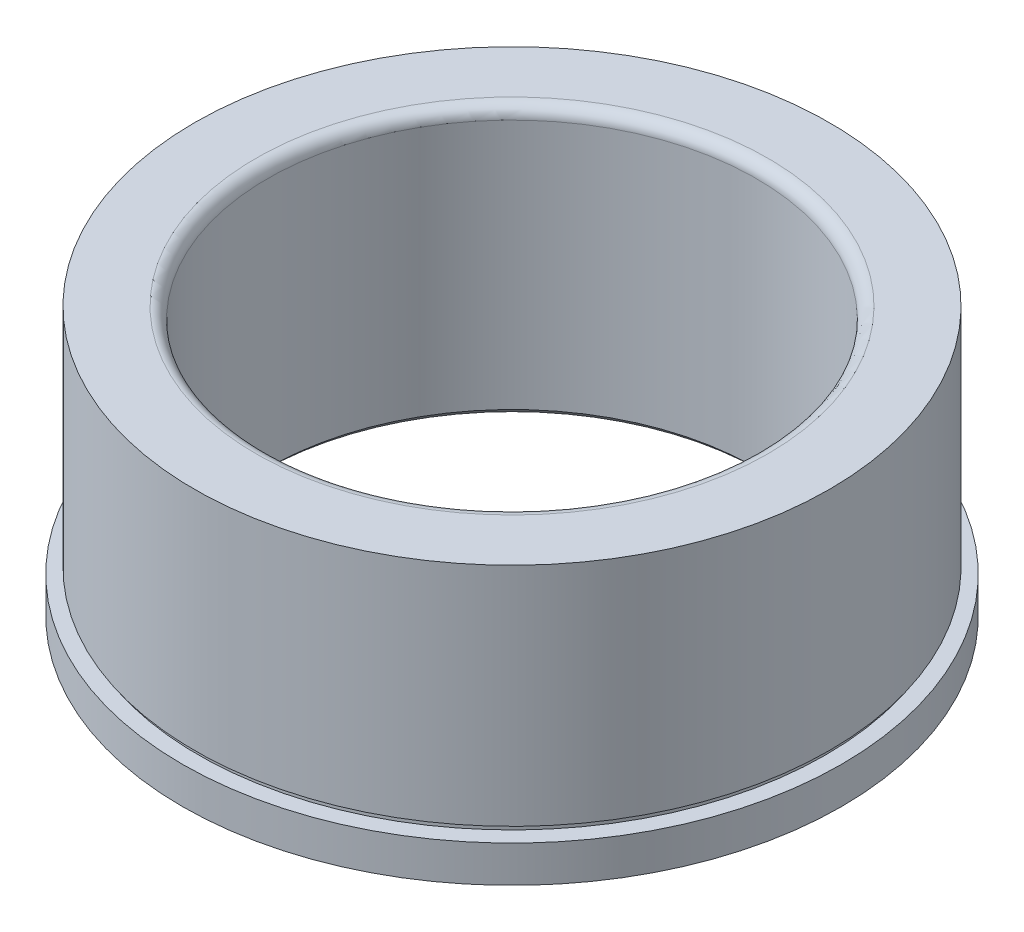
from build123d import *

# Parameters (mm, degrees)
FILLET1_R = 1.524


with BuildPart() as part:
    # Sketch1 → Revolve1 (revolve)
    with BuildSketch(Plane.XY, mode=Mode.PRIVATE) as revolve1_sk:
        Polygon((-31.75635, 50.850690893), (-31.75635, 16.741746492), (-32.572405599, 15.925690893), (-42.8625, 15.925690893), (-42.8625, 20.688190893), (-40.77335, 20.688190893), (-40.77335, 21.450190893), (-41.28135, 21.450190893), (-41.28135, 50.850690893), align=None)
    revolve(revolve1_sk.sketch.rotate(Axis((0, -1000, 0), (0, 1, 0)), 180), axis=Axis((0, -1000, 0), (0, 1, 0)))

    # Fillet1
    fillet1_edges = [part.edges().sort_by_distance(p)[0] for p in [
        (-31.75635, 50.850690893, 0),
    ]]
    fillet(fillet1_edges, radius=FILLET1_R)


solid = part.part
